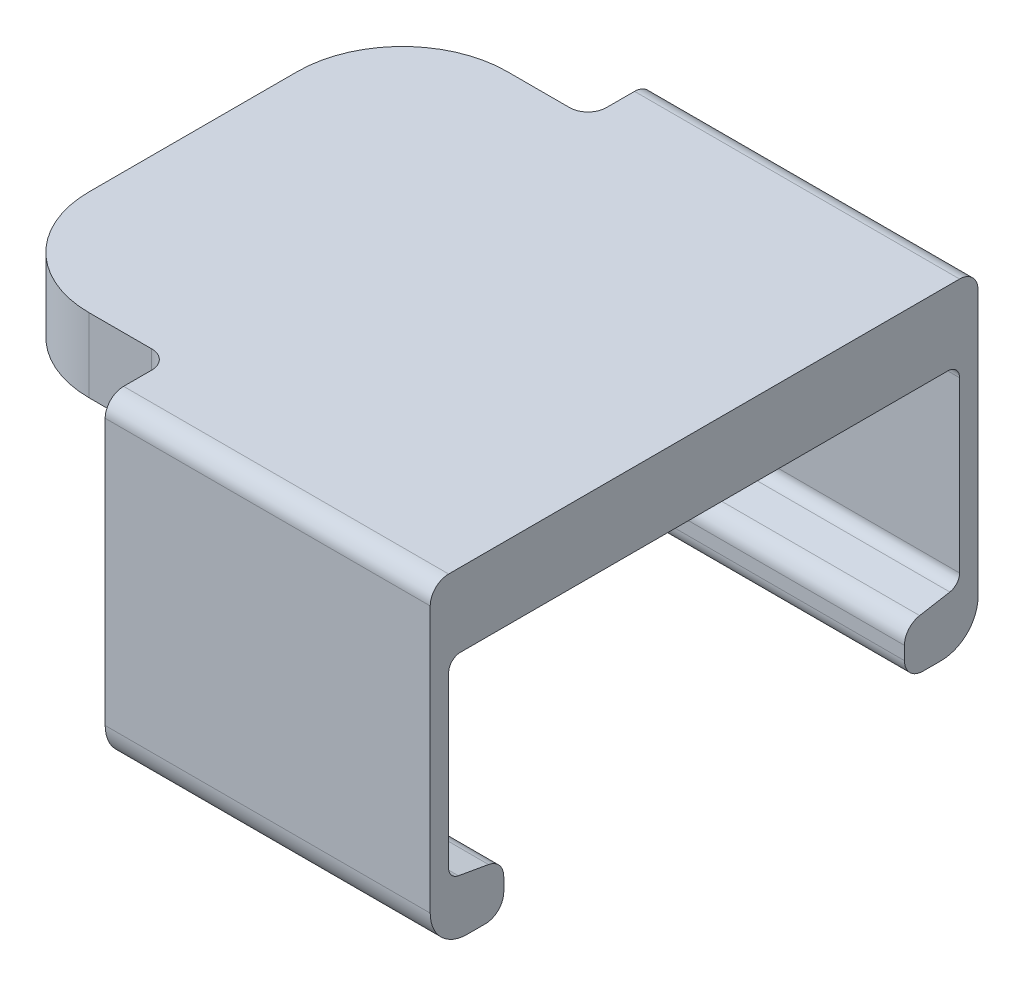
from build123d import *

# Parameters (mm, degrees)
BOSS_EXTRUDE1_DEPTH      = 14
BOSS_EXTRUDE1_DEPTH_BACK = 14
SKETCH2_W                = 36
SKETCH2_H                = 6.35
BOSS_EXTRUDE2_DEPTH      = 16
FILLET1_R                = 9.0297
FILLET2_R                = 3.175
FILLET3_R                = 1.016
FILLET4_R                = 1.5875
SKETCH3_R                = 9.0297
CUT_EXTRUDE1_DEPTH       = 3.048


with BuildPart() as part:
    # Sketch1 → Boss-Extrude1 (new, two sides: drawn at the far end of the back side and taken through both)
    with BuildSketch(Plane(origin=(0, 0, 0), x_dir=(0, 0, -1), z_dir=(1, 0, 0)).offset(-BOSS_EXTRUDE1_DEPTH_BACK)):
        Polygon((-23.5955, -10.325348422), (-17.258, -10.325348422), (-17.258, -6.263815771), (-22.008, -5.426262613), (-22.008, 11.008), (0, 11.008), (22.008, 11.008), (22.008, -5.426262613), (17.258, -6.263815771), (17.258, -10.325348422), (23.5955, -10.325348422), (23.5955, 17.358), (0, 17.358), (-23.5955, 17.358), align=None)
    extrude(amount=BOSS_EXTRUDE1_DEPTH + BOSS_EXTRUDE1_DEPTH_BACK)

    # Sketch2 → Boss-Extrude2 (add)
    with BuildSketch(Plane.ZY.offset(14)):
        with Locations((0, 14.183)):
            Rectangle(SKETCH2_W, SKETCH2_H)
    extrude(amount=BOSS_EXTRUDE2_DEPTH)

    # Fillet1
    fillet1_edges = [part.edges().sort_by_distance(p)[0] for p in [
        (-30, 14.183, -18),
        (-30, 14.183, 18),
    ]]
    fillet(fillet1_edges, radius=FILLET1_R)

    # Fillet2
    fillet2_edges = [part.edges().sort_by_distance(p)[0] for p in [
        (0, -10.325348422, 23.5955),
        (0, -10.325348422, -23.5955),
    ]]
    fillet(fillet2_edges, radius=FILLET2_R)

    # Fillet3
    fillet3_edges = [part.edges().sort_by_distance(p)[0] for p in [
        (0, -5.426262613, -22.008),
        (0, 11.008, -22.008),
        (0, 11.008, 22.008),
        (0, -5.426262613, 22.008),
    ]]
    fillet(fillet3_edges, radius=FILLET3_R)

    # Fillet4
    fillet4_edges = [part.edges().sort_by_distance(p)[0] for p in [
        (0, -6.263815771, 17.258),
        (0, -10.325348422, 17.258),
        (0, 17.358, 23.5955),
        (0, 17.358, -23.5955),
        (0, -10.325348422, -17.258),
        (0, -6.263815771, -17.258),
        (-14, 14.183, -18),
        (-14, 14.183, 18),
    ]]
    fillet(fillet4_edges, radius=FILLET4_R)

    # Sketch3 → Cut-Extrude1 (cut)
    with BuildSketch(Plane(origin=(0, 11.008, 0), x_dir=(-1, 0, 0), z_dir=(0, -1, 0))):
        with Locations(Location((20.1575, -8.1575, 0), (0, 0, 90))):
            Circle(SKETCH3_R)
    extrude(amount=-CUT_EXTRUDE1_DEPTH, mode=Mode.SUBTRACT)


solid = part.part
